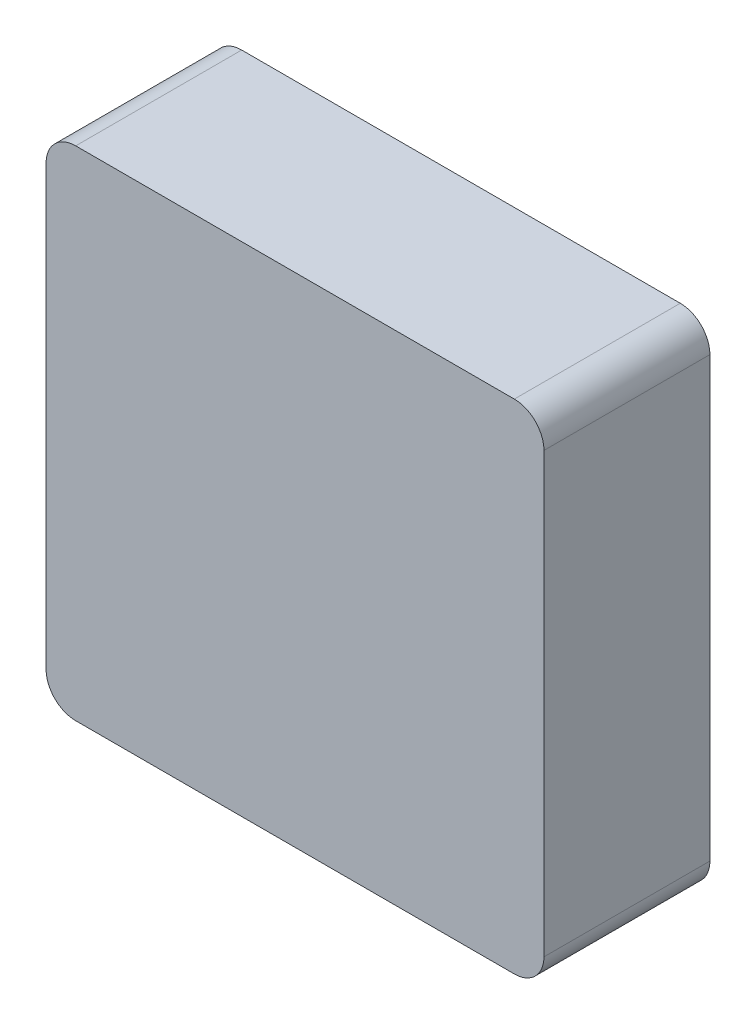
ISO-10303-21;
HEADER;
FILE_DESCRIPTION(('STEP AP214'),'2;1');
FILE_NAME('part.step','',(''),(''),'','','');
FILE_SCHEMA(('AUTOMOTIVE_DESIGN { 1 0 10303 214 1 1 1 1 }'));
ENDSEC;
DATA;
#1=APPLICATION_CONTEXT('core data for automotive mechanical design processes');
#2=APPLICATION_PROTOCOL_DEFINITION('international standard','automotive_design',2000,#1);
#3=PRODUCT_CONTEXT('',#1,'mechanical');
#4=PRODUCT('Part','Part','',(#3));
#5=PRODUCT_RELATED_PRODUCT_CATEGORY('part','',(#4));
#6=PRODUCT_DEFINITION_FORMATION('','',#4);
#7=PRODUCT_DEFINITION_CONTEXT('part definition',#1,'design');
#8=PRODUCT_DEFINITION('design','',#6,#7);
#9=PRODUCT_DEFINITION_SHAPE('','',#8);
#10=(LENGTH_UNIT() NAMED_UNIT(*) SI_UNIT(.MILLI.,.METRE.));
#11=(NAMED_UNIT(*) PLANE_ANGLE_UNIT() SI_UNIT($,.RADIAN.));
#12=(NAMED_UNIT(*) SI_UNIT($,.STERADIAN.) SOLID_ANGLE_UNIT());
#13=UNCERTAINTY_MEASURE_WITH_UNIT(LENGTH_MEASURE(1.E-05),#10,'distance_accuracy_value','');
#14=(GEOMETRIC_REPRESENTATION_CONTEXT(3) GLOBAL_UNCERTAINTY_ASSIGNED_CONTEXT((#13)) GLOBAL_UNIT_ASSIGNED_CONTEXT((#10,
#11,#12)) REPRESENTATION_CONTEXT('',''));
#15=CARTESIAN_POINT('',(0.,0.,0.));
#16=DIRECTION('',(0.,0.,1.));
#17=DIRECTION('',(1.,0.,0.));
#18=AXIS2_PLACEMENT_3D('',#15,#16,#17);
#19=CARTESIAN_POINT('',(-37.,37.,28.));
#20=DIRECTION('',(0.,0.,-1.));
#21=DIRECTION('',(-1.,0.,0.));
#22=AXIS2_PLACEMENT_3D('',#19,#20,#21);
#23=CYLINDRICAL_SURFACE('',#22,5.);
#24=CARTESIAN_POINT('',(-37.,37.,0.));
#25=DIRECTION('',(0.,0.,1.));
#26=DIRECTION('',(-1.,0.,0.));
#27=AXIS2_PLACEMENT_3D('',#24,#25,#26);
#28=CIRCLE('',#27,5.);
#29=CARTESIAN_POINT('',(-37.,42.,0.));
#30=VERTEX_POINT('',#29);
#31=CARTESIAN_POINT('',(-42.,37.,0.));
#32=VERTEX_POINT('',#31);
#33=EDGE_CURVE('E146',#30,#32,#28,.T.);
#34=ORIENTED_EDGE('',*,*,#33,.T.);
#35=DIRECTION('',(0.,0.,-1.));
#36=VECTOR('',#35,1.);
#37=CARTESIAN_POINT('',(-42.,37.,28.));
#38=LINE('',#37,#36);
#39=CARTESIAN_POINT('',(-42.,37.,28.));
#40=VERTEX_POINT('',#39);
#41=EDGE_CURVE('E11',#40,#32,#38,.T.);
#42=ORIENTED_EDGE('',*,*,#41,.F.);
#43=CARTESIAN_POINT('',(-37.,37.,28.));
#44=DIRECTION('',(0.,0.,1.));
#45=DIRECTION('',(-1.,0.,0.));
#46=AXIS2_PLACEMENT_3D('',#43,#44,#45);
#47=CIRCLE('',#46,5.);
#48=CARTESIAN_POINT('',(-37.,42.,28.));
#49=VERTEX_POINT('',#48);
#50=EDGE_CURVE('E168',#49,#40,#47,.T.);
#51=ORIENTED_EDGE('',*,*,#50,.F.);
#52=DIRECTION('',(0.,0.,-1.));
#53=VECTOR('',#52,1.);
#54=CARTESIAN_POINT('',(-37.,42.,28.));
#55=LINE('',#54,#53);
#56=EDGE_CURVE('E142',#49,#30,#55,.T.);
#57=ORIENTED_EDGE('',*,*,#56,.T.);
#58=EDGE_LOOP('',(#34,#42,#51,#57));
#59=FACE_BOUND('',#58,.T.);
#60=ADVANCED_FACE('F45',(#59),#23,.T.);
#61=CARTESIAN_POINT('',(-42.,-37.,28.));
#62=DIRECTION('',(1.,0.,0.));
#63=DIRECTION('',(0.,0.,-1.));
#64=AXIS2_PLACEMENT_3D('',#61,#62,#63);
#65=PLANE('',#64);
#66=DIRECTION('',(0.,-1.,0.));
#67=VECTOR('',#66,1.);
#68=CARTESIAN_POINT('',(-42.,-37.,0.));
#69=LINE('',#68,#67);
#70=CARTESIAN_POINT('',(-42.,-37.,0.));
#71=VERTEX_POINT('',#70);
#72=EDGE_CURVE('E150',#32,#71,#69,.T.);
#73=ORIENTED_EDGE('',*,*,#72,.T.);
#74=DIRECTION('',(0.,0.,-1.));
#75=VECTOR('',#74,1.);
#76=CARTESIAN_POINT('',(-42.,-37.,28.));
#77=LINE('',#76,#75);
#78=CARTESIAN_POINT('',(-42.,-37.,28.));
#79=VERTEX_POINT('',#78);
#80=EDGE_CURVE('E54',#79,#71,#77,.T.);
#81=ORIENTED_EDGE('',*,*,#80,.F.);
#82=DIRECTION('',(0.,-1.,0.));
#83=VECTOR('',#82,1.);
#84=CARTESIAN_POINT('',(-42.,-37.,28.));
#85=LINE('',#84,#83);
#86=EDGE_CURVE('E105',#40,#79,#85,.T.);
#87=ORIENTED_EDGE('',*,*,#86,.F.);
#88=ORIENTED_EDGE('',*,*,#41,.T.);
#89=EDGE_LOOP('',(#73,#81,#87,#88));
#90=FACE_BOUND('',#89,.T.);
#91=ADVANCED_FACE('F214',(#90),#65,.F.);
#92=CARTESIAN_POINT('',(-37.,-37.,28.));
#93=DIRECTION('',(0.,0.,-1.));
#94=DIRECTION('',(-1.,0.,0.));
#95=AXIS2_PLACEMENT_3D('',#92,#93,#94);
#96=CYLINDRICAL_SURFACE('',#95,5.);
#97=CARTESIAN_POINT('',(-37.,-37.,0.));
#98=DIRECTION('',(0.,0.,1.));
#99=DIRECTION('',(-1.,0.,0.));
#100=AXIS2_PLACEMENT_3D('',#97,#98,#99);
#101=CIRCLE('',#100,5.);
#102=CARTESIAN_POINT('',(-37.,-42.,0.));
#103=VERTEX_POINT('',#102);
#104=EDGE_CURVE('E153',#71,#103,#101,.T.);
#105=ORIENTED_EDGE('',*,*,#104,.T.);
#106=DIRECTION('',(0.,0.,-1.));
#107=VECTOR('',#106,1.);
#108=CARTESIAN_POINT('',(-37.,-42.,28.));
#109=LINE('',#108,#107);
#110=CARTESIAN_POINT('',(-37.,-42.,28.));
#111=VERTEX_POINT('',#110);
#112=EDGE_CURVE('E179',#111,#103,#109,.T.);
#113=ORIENTED_EDGE('',*,*,#112,.F.);
#114=CARTESIAN_POINT('',(-37.,-37.,28.));
#115=DIRECTION('',(0.,0.,1.));
#116=DIRECTION('',(-1.,0.,0.));
#117=AXIS2_PLACEMENT_3D('',#114,#115,#116);
#118=CIRCLE('',#117,5.);
#119=EDGE_CURVE('E189',#79,#111,#118,.T.);
#120=ORIENTED_EDGE('',*,*,#119,.F.);
#121=ORIENTED_EDGE('',*,*,#80,.T.);
#122=EDGE_LOOP('',(#105,#113,#120,#121));
#123=FACE_BOUND('',#122,.T.);
#124=ADVANCED_FACE('F187',(#123),#96,.T.);
#125=CARTESIAN_POINT('',(37.,-42.,28.));
#126=DIRECTION('',(0.,1.,0.));
#127=DIRECTION('',(0.,0.,1.));
#128=AXIS2_PLACEMENT_3D('',#125,#126,#127);
#129=PLANE('',#128);
#130=DIRECTION('',(1.,0.,0.));
#131=VECTOR('',#130,1.);
#132=CARTESIAN_POINT('',(37.,-42.,0.));
#133=LINE('',#132,#131);
#134=CARTESIAN_POINT('',(37.,-42.,0.));
#135=VERTEX_POINT('',#134);
#136=EDGE_CURVE('E156',#103,#135,#133,.T.);
#137=ORIENTED_EDGE('',*,*,#136,.T.);
#138=DIRECTION('',(0.,0.,-1.));
#139=VECTOR('',#138,1.);
#140=CARTESIAN_POINT('',(37.,-42.,28.));
#141=LINE('',#140,#139);
#142=CARTESIAN_POINT('',(37.,-42.,28.));
#143=VERTEX_POINT('',#142);
#144=EDGE_CURVE('E175',#143,#135,#141,.T.);
#145=ORIENTED_EDGE('',*,*,#144,.F.);
#146=DIRECTION('',(1.,0.,0.));
#147=VECTOR('',#146,1.);
#148=CARTESIAN_POINT('',(37.,-42.,28.));
#149=LINE('',#148,#147);
#150=EDGE_CURVE('E202',#111,#143,#149,.T.);
#151=ORIENTED_EDGE('',*,*,#150,.F.);
#152=ORIENTED_EDGE('',*,*,#112,.T.);
#153=EDGE_LOOP('',(#137,#145,#151,#152));
#154=FACE_BOUND('',#153,.T.);
#155=ADVANCED_FACE('F197',(#154),#129,.F.);
#156=CARTESIAN_POINT('',(37.,-37.,28.));
#157=DIRECTION('',(0.,0.,-1.));
#158=DIRECTION('',(-1.,0.,0.));
#159=AXIS2_PLACEMENT_3D('',#156,#157,#158);
#160=CYLINDRICAL_SURFACE('',#159,5.);
#161=CARTESIAN_POINT('',(37.,-37.,0.));
#162=DIRECTION('',(0.,0.,1.));
#163=DIRECTION('',(-1.,0.,0.));
#164=AXIS2_PLACEMENT_3D('',#161,#162,#163);
#165=CIRCLE('',#164,5.);
#166=CARTESIAN_POINT('',(42.,-37.,0.));
#167=VERTEX_POINT('',#166);
#168=EDGE_CURVE('E159',#135,#167,#165,.T.);
#169=ORIENTED_EDGE('',*,*,#168,.T.);
#170=DIRECTION('',(0.,0.,-1.));
#171=VECTOR('',#170,1.);
#172=CARTESIAN_POINT('',(42.,-37.,28.));
#173=LINE('',#172,#171);
#174=CARTESIAN_POINT('',(42.,-37.,28.));
#175=VERTEX_POINT('',#174);
#176=EDGE_CURVE('E135',#175,#167,#173,.T.);
#177=ORIENTED_EDGE('',*,*,#176,.F.);
#178=CARTESIAN_POINT('',(37.,-37.,28.));
#179=DIRECTION('',(0.,0.,1.));
#180=DIRECTION('',(-1.,0.,0.));
#181=AXIS2_PLACEMENT_3D('',#178,#179,#180);
#182=CIRCLE('',#181,5.);
#183=EDGE_CURVE('E124',#143,#175,#182,.T.);
#184=ORIENTED_EDGE('',*,*,#183,.F.);
#185=ORIENTED_EDGE('',*,*,#144,.T.);
#186=EDGE_LOOP('',(#169,#177,#184,#185));
#187=FACE_BOUND('',#186,.T.);
#188=ADVANCED_FACE('F200',(#187),#160,.T.);
#189=CARTESIAN_POINT('',(42.,-37.,28.));
#190=DIRECTION('',(-1.,0.,0.));
#191=DIRECTION('',(0.,0.,1.));
#192=AXIS2_PLACEMENT_3D('',#189,#190,#191);
#193=PLANE('',#192);
#194=DIRECTION('',(0.,1.,0.));
#195=VECTOR('',#194,1.);
#196=CARTESIAN_POINT('',(42.,-37.,0.));
#197=LINE('',#196,#195);
#198=CARTESIAN_POINT('',(42.,37.,0.));
#199=VERTEX_POINT('',#198);
#200=EDGE_CURVE('E133',#167,#199,#197,.T.);
#201=ORIENTED_EDGE('',*,*,#200,.T.);
#202=DIRECTION('',(0.,0.,-1.));
#203=VECTOR('',#202,1.);
#204=CARTESIAN_POINT('',(42.,37.,28.));
#205=LINE('',#204,#203);
#206=CARTESIAN_POINT('',(42.,37.,28.));
#207=VERTEX_POINT('',#206);
#208=EDGE_CURVE('E130',#207,#199,#205,.T.);
#209=ORIENTED_EDGE('',*,*,#208,.F.);
#210=DIRECTION('',(0.,1.,0.));
#211=VECTOR('',#210,1.);
#212=CARTESIAN_POINT('',(42.,-37.,28.));
#213=LINE('',#212,#211);
#214=EDGE_CURVE('E118',#175,#207,#213,.T.);
#215=ORIENTED_EDGE('',*,*,#214,.F.);
#216=ORIENTED_EDGE('',*,*,#176,.T.);
#217=EDGE_LOOP('',(#201,#209,#215,#216));
#218=FACE_BOUND('',#217,.T.);
#219=ADVANCED_FACE('F131',(#218),#193,.F.);
#220=CARTESIAN_POINT('',(37.,37.,28.));
#221=DIRECTION('',(0.,0.,-1.));
#222=DIRECTION('',(-1.,0.,0.));
#223=AXIS2_PLACEMENT_3D('',#220,#221,#222);
#224=CYLINDRICAL_SURFACE('',#223,5.);
#225=CARTESIAN_POINT('',(37.,37.,0.));
#226=DIRECTION('',(0.,0.,1.));
#227=DIRECTION('',(-1.,0.,0.));
#228=AXIS2_PLACEMENT_3D('',#225,#226,#227);
#229=CIRCLE('',#228,5.);
#230=CARTESIAN_POINT('',(37.,42.,0.));
#231=VERTEX_POINT('',#230);
#232=EDGE_CURVE('E91',#199,#231,#229,.T.);
#233=ORIENTED_EDGE('',*,*,#232,.T.);
#234=DIRECTION('',(0.,0.,-1.));
#235=VECTOR('',#234,1.);
#236=CARTESIAN_POINT('',(37.,42.,28.));
#237=LINE('',#236,#235);
#238=CARTESIAN_POINT('',(37.,42.,28.));
#239=VERTEX_POINT('',#238);
#240=EDGE_CURVE('E136',#239,#231,#237,.T.);
#241=ORIENTED_EDGE('',*,*,#240,.F.);
#242=CARTESIAN_POINT('',(37.,37.,28.));
#243=DIRECTION('',(0.,0.,1.));
#244=DIRECTION('',(-1.,0.,0.));
#245=AXIS2_PLACEMENT_3D('',#242,#243,#244);
#246=CIRCLE('',#245,5.);
#247=EDGE_CURVE('E122',#207,#239,#246,.T.);
#248=ORIENTED_EDGE('',*,*,#247,.F.);
#249=ORIENTED_EDGE('',*,*,#208,.T.);
#250=EDGE_LOOP('',(#233,#241,#248,#249));
#251=FACE_BOUND('',#250,.T.);
#252=ADVANCED_FACE('F138',(#251),#224,.T.);
#253=CARTESIAN_POINT('',(37.,42.,28.));
#254=DIRECTION('',(0.,-1.,0.));
#255=DIRECTION('',(0.,0.,-1.));
#256=AXIS2_PLACEMENT_3D('',#253,#254,#255);
#257=PLANE('',#256);
#258=DIRECTION('',(-1.,0.,0.));
#259=VECTOR('',#258,1.);
#260=CARTESIAN_POINT('',(37.,42.,0.));
#261=LINE('',#260,#259);
#262=EDGE_CURVE('E97',#231,#30,#261,.T.);
#263=ORIENTED_EDGE('',*,*,#262,.T.);
#264=ORIENTED_EDGE('',*,*,#56,.F.);
#265=DIRECTION('',(-1.,0.,0.));
#266=VECTOR('',#265,1.);
#267=CARTESIAN_POINT('',(37.,42.,28.));
#268=LINE('',#267,#266);
#269=EDGE_CURVE('E62',#239,#49,#268,.T.);
#270=ORIENTED_EDGE('',*,*,#269,.F.);
#271=ORIENTED_EDGE('',*,*,#240,.T.);
#272=EDGE_LOOP('',(#263,#264,#270,#271));
#273=FACE_BOUND('',#272,.T.);
#274=ADVANCED_FACE('F230',(#273),#257,.F.);
#275=CARTESIAN_POINT('',(-37.,37.,28.));
#276=DIRECTION('',(0.,0.,-1.));
#277=DIRECTION('',(-1.,0.,0.));
#278=AXIS2_PLACEMENT_3D('',#275,#276,#277);
#279=PLANE('',#278);
#280=ORIENTED_EDGE('',*,*,#50,.T.);
#281=ORIENTED_EDGE('',*,*,#86,.T.);
#282=ORIENTED_EDGE('',*,*,#119,.T.);
#283=ORIENTED_EDGE('',*,*,#150,.T.);
#284=ORIENTED_EDGE('',*,*,#183,.T.);
#285=ORIENTED_EDGE('',*,*,#214,.T.);
#286=ORIENTED_EDGE('',*,*,#247,.T.);
#287=ORIENTED_EDGE('',*,*,#269,.T.);
#288=EDGE_LOOP('',(#280,#281,#282,#283,#284,#285,#286,#287));
#289=FACE_BOUND('',#288,.T.);
#290=ADVANCED_FACE('F120',(#289),#279,.F.);
#291=CARTESIAN_POINT('',(-37.,37.,0.));
#292=DIRECTION('',(0.,0.,-1.));
#293=DIRECTION('',(-1.,0.,0.));
#294=AXIS2_PLACEMENT_3D('',#291,#292,#293);
#295=PLANE('',#294);
#296=ORIENTED_EDGE('',*,*,#33,.F.);
#297=ORIENTED_EDGE('',*,*,#262,.F.);
#298=ORIENTED_EDGE('',*,*,#232,.F.);
#299=ORIENTED_EDGE('',*,*,#200,.F.);
#300=ORIENTED_EDGE('',*,*,#168,.F.);
#301=ORIENTED_EDGE('',*,*,#136,.F.);
#302=ORIENTED_EDGE('',*,*,#104,.F.);
#303=ORIENTED_EDGE('',*,*,#72,.F.);
#304=EDGE_LOOP('',(#296,#297,#298,#299,#300,#301,#302,#303));
#305=FACE_BOUND('',#304,.T.);
#306=ADVANCED_FACE('F193',(#305),#295,.T.);
#307=CLOSED_SHELL('',(#60,#91,#124,#155,#188,#219,#252,#274,#290,#306));
#308=MANIFOLD_SOLID_BREP('B2',#307);
#309=ADVANCED_BREP_SHAPE_REPRESENTATION('',(#18,#308),#14);
#310=SHAPE_DEFINITION_REPRESENTATION(#9,#309);
ENDSEC;
END-ISO-10303-21;
